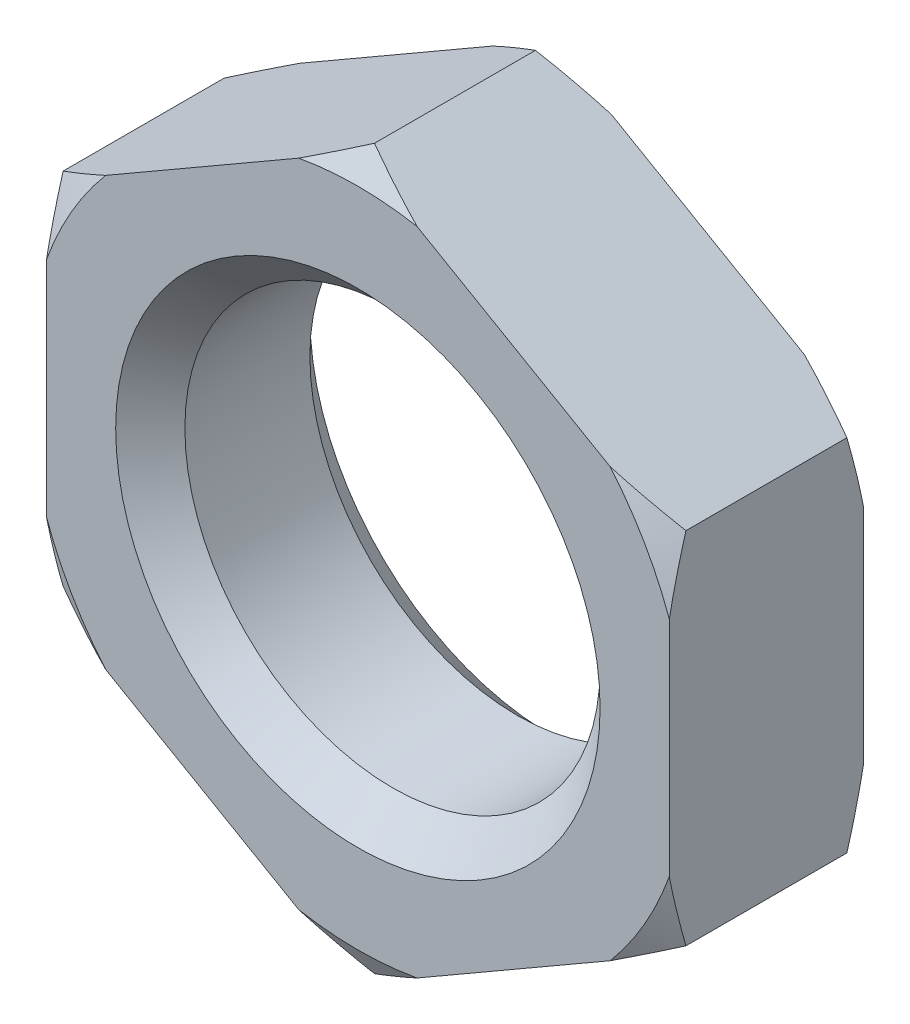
from build123d import *

# Parameters (mm, degrees)
SKETCH1_R           = 9
BOSS_EXTRUDE1_DEPTH = 4.21
CHAMFER1_SIZE       = 1.5


with BuildPart() as part:
    # Sketch1 → Boss-Extrude1 (new, symmetric)
    with BuildSketch(Plane.XY):
        Polygon((0, 15.588457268), (-13.5, 7.794228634), (-13.5, -7.794228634), (0, -15.588457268), (13.5, -7.794228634), (13.5, 7.794228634), align=None)
        Circle(SKETCH1_R, mode=Mode.SUBTRACT)
    extrude(amount=BOSS_EXTRUDE1_DEPTH, both=True)

    # Sketch3 → Cut-Revolve1 (revolve, cut)
    with BuildSketch(Plane(origin=(0, 0, 0), x_dir=(0, 0, -1), z_dir=(1, 0, 0))):
        Polygon((-4.21, 15.588457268), (-4.21, 14.338457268), (-3.488312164, 15.588457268), align=None)
    cut_revolve1 = revolve(axis=Axis((0, 0, -7.477018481), (0, 0, 1)), mode=Mode.SUBTRACT)

    # Mirror1: Cut-Revolve1 across plane
    add(cut_revolve1.mirror(Plane.XY), mode=Mode.SUBTRACT)

    # Chamfer1
    chamfer1_edges = [part.edges().sort_by_distance(p)[0] for p in [
        (-9, 0, -4.21),
        (-9, 0, 4.21),
    ]]
    chamfer(chamfer1_edges, length=CHAMFER1_SIZE)


solid = part.part
